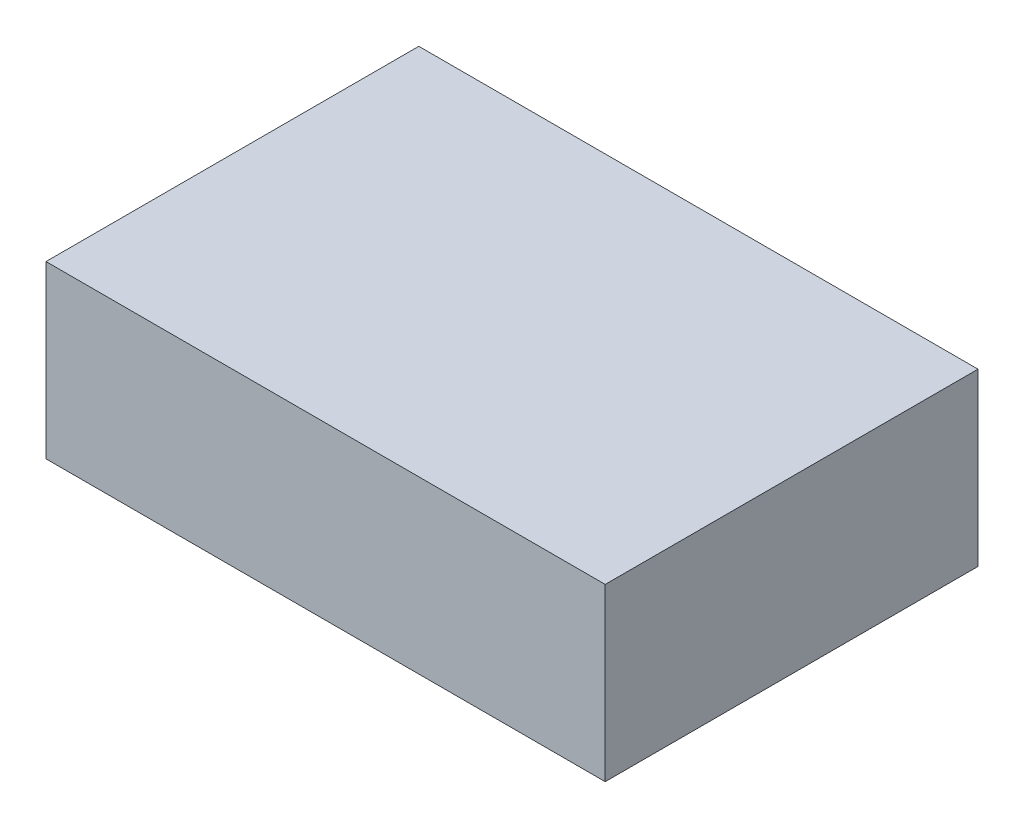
from build123d import *

# Parameters (mm, degrees)
SKETCH1_W           = 45.72
SKETCH1_H           = 30.48
BOSS_EXTRUDE1_DEPTH = 13.97


with BuildPart() as part:
    # Sketch1 → Boss-Extrude1 (new body)
    with BuildSketch(Plane(origin=(0, 0, 0), x_dir=(1, 0, 0), z_dir=(0, 1, 0))):
        with Locations((22.86, 15.24)):
            Rectangle(SKETCH1_W, SKETCH1_H)
    extrude(amount=BOSS_EXTRUDE1_DEPTH)


solid = part.part
